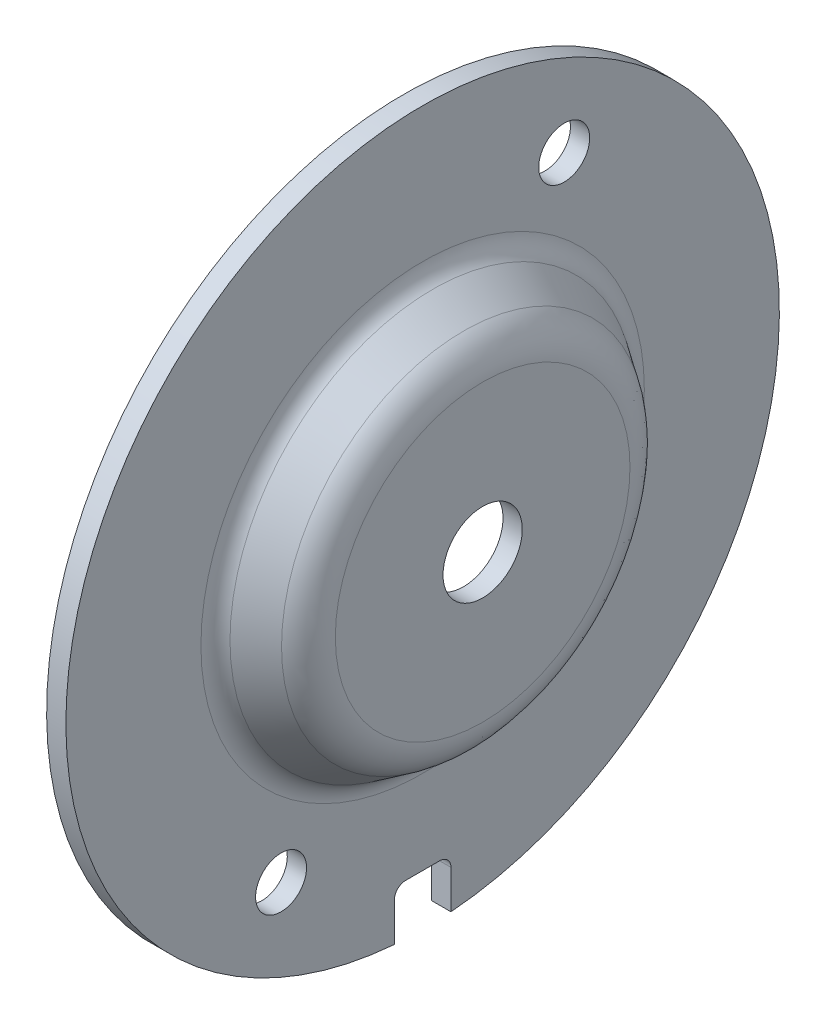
from build123d import *

# Parameters (mm, degrees)
ESQUISSE2_R             = 2.25
ENL_V_MAT_EXTRU_1_DEPTH = 45.861899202
ENL_V_MAT_EXTRU_2_DEPTH = 45.861899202
CONG_1_R                = 1


with BuildPart() as part:
    # Esquisse1 → R_volution1 (revolve)
    with BuildSketch(Plane.XY, mode=Mode.PRIVATE) as r_volution1_sk:
        with BuildLine():
            Line((53, 31.5), (54.7, 31.5))
            Line((54.7, 31.5), (54.7, 19.575991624))
            ThreePointArc((54.7, 19.575991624), (54.938715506, 18.628427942), (55.597876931, 17.907062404))
            Line((55.597876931, 17.907062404), (58.338927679, 16.096934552))
            ThreePointArc((58.338927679, 16.096934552), (59.558376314, 14.762408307), (60, 13.009415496))
            Line((60, 13.009415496), (60, 3.5))
            Line((60, 3.5), (58.3, 3.5))
            Line((58.3, 3.5), (58.3, 13.009415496))
            ThreePointArc((58.3, 13.009415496), (58.061284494, 13.956979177), (57.402123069, 14.678344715))
            Line((57.402123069, 14.678344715), (54.661072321, 16.488472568))
            ThreePointArc((54.661072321, 16.488472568), (53.441623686, 17.822998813), (53, 19.575991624))
            Line((53, 19.575991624), (53, 31.5))
        make_face()
    revolve(r_volution1_sk.sketch.rotate(Axis((0, 0, 0), (1, 0, 0)), 90), axis=Axis((0, 0, 0), (1, 0, 0)))

    # Esquisse2 → Enl_v. mat.-Extru.1 (cut, through all)
    with BuildSketch(Plane(origin=(54.7, 0, 0), x_dir=(0, 0, -1), z_dir=(1, 0, 0))):
        with Locations((12.5, 21.650635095)):
            Circle(ESQUISSE2_R)
        with Locations((-12.5, -21.650635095)):
            Circle(ESQUISSE2_R)
    extrude(amount=-ENL_V_MAT_EXTRU_1_DEPTH, mode=Mode.SUBTRACT)

    # Esquisse3 → Enl_v. mat.-Extru.2 (cut, through all)
    with BuildSketch(Plane(origin=(54.7, 0, 0), x_dir=(0, 0, -1), z_dir=(1, 0, 0))):
        with BuildLine():
            Line((-2.5, -31.400636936), (-2.5, -27))
            Line((-2.5, -27), (2.5, -27))
            Line((2.5, -27), (2.5, -31.400636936))
            ThreePointArc((2.5, -31.400636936), (0, -31.5), (-2.5, -31.400636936))
        make_face()
    extrude(amount=-ENL_V_MAT_EXTRU_2_DEPTH, mode=Mode.SUBTRACT)

    # Cong_1
    cong_1_edges = [part.edges().sort_by_distance(p)[0] for p in [
        (53.85, -27, 2.5),
        (53.85, -27, -2.5),
    ]]
    fillet(cong_1_edges, radius=CONG_1_R)


solid = part.part
